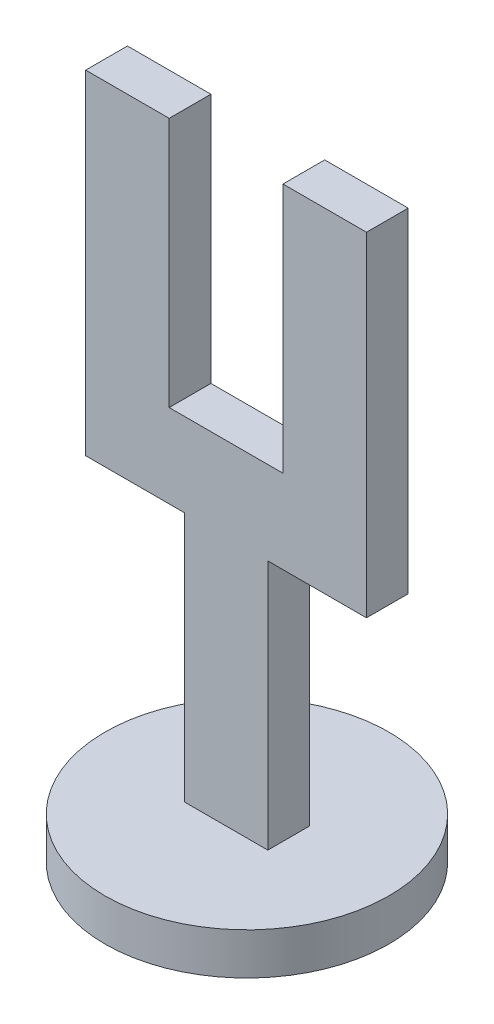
ISO-10303-21;
HEADER;
FILE_DESCRIPTION(('STEP AP214'),'2;1');
FILE_NAME('part.step','',(''),(''),'','','');
FILE_SCHEMA(('AUTOMOTIVE_DESIGN { 1 0 10303 214 1 1 1 1 }'));
ENDSEC;
DATA;
#1=APPLICATION_CONTEXT('core data for automotive mechanical design processes');
#2=APPLICATION_PROTOCOL_DEFINITION('international standard','automotive_design',2000,#1);
#3=PRODUCT_CONTEXT('',#1,'mechanical');
#4=PRODUCT('Part','Part','',(#3));
#5=PRODUCT_RELATED_PRODUCT_CATEGORY('part','',(#4));
#6=PRODUCT_DEFINITION_FORMATION('','',#4);
#7=PRODUCT_DEFINITION_CONTEXT('part definition',#1,'design');
#8=PRODUCT_DEFINITION('design','',#6,#7);
#9=PRODUCT_DEFINITION_SHAPE('','',#8);
#10=(LENGTH_UNIT() NAMED_UNIT(*) SI_UNIT(.MILLI.,.METRE.));
#11=(NAMED_UNIT(*) PLANE_ANGLE_UNIT() SI_UNIT($,.RADIAN.));
#12=(NAMED_UNIT(*) SI_UNIT($,.STERADIAN.) SOLID_ANGLE_UNIT());
#13=UNCERTAINTY_MEASURE_WITH_UNIT(LENGTH_MEASURE(1.E-05),#10,'distance_accuracy_value','');
#14=(GEOMETRIC_REPRESENTATION_CONTEXT(3) GLOBAL_UNCERTAINTY_ASSIGNED_CONTEXT((#13)) GLOBAL_UNIT_ASSIGNED_CONTEXT((#10,
#11,#12)) REPRESENTATION_CONTEXT('',''));
#15=CARTESIAN_POINT('',(0.,0.,0.));
#16=DIRECTION('',(0.,0.,1.));
#17=DIRECTION('',(1.,0.,0.));
#18=AXIS2_PLACEMENT_3D('',#15,#16,#17);
#19=CARTESIAN_POINT('',(0.,5.,0.));
#20=DIRECTION('',(0.,-1.,0.));
#21=DIRECTION('',(0.,0.,-1.));
#22=AXIS2_PLACEMENT_3D('',#19,#20,#21);
#23=CYLINDRICAL_SURFACE('',#22,17.);
#24=CARTESIAN_POINT('',(0.,5.,0.));
#25=DIRECTION('',(0.,1.,0.));
#26=DIRECTION('',(0.,0.,1.));
#27=AXIS2_PLACEMENT_3D('',#24,#25,#26);
#28=CIRCLE('',#27,17.);
#29=CARTESIAN_POINT('',(0.,5.,17.));
#30=VERTEX_POINT('',#29);
#31=EDGE_CURVE('E11',#30,#30,#28,.T.);
#32=ORIENTED_EDGE('',*,*,#31,.F.);
#33=EDGE_LOOP('',(#32));
#34=FACE_BOUND('',#33,.T.);
#35=CARTESIAN_POINT('',(0.,0.,0.));
#36=DIRECTION('',(0.,1.,0.));
#37=DIRECTION('',(0.,0.,1.));
#38=AXIS2_PLACEMENT_3D('',#35,#36,#37);
#39=CIRCLE('',#38,17.);
#40=CARTESIAN_POINT('',(0.,0.,17.));
#41=VERTEX_POINT('',#40);
#42=EDGE_CURVE('E48',#41,#41,#39,.T.);
#43=ORIENTED_EDGE('',*,*,#42,.T.);
#44=EDGE_LOOP('',(#43));
#45=FACE_BOUND('',#44,.T.);
#46=ADVANCED_FACE('F45',(#34,#45),#23,.T.);
#47=CARTESIAN_POINT('',(0.,5.,0.));
#48=DIRECTION('',(0.,1.,0.));
#49=DIRECTION('',(0.,0.,1.));
#50=AXIS2_PLACEMENT_3D('',#47,#48,#49);
#51=PLANE('',#50);
#52=DIRECTION('',(0.,0.,-1.));
#53=VECTOR('',#52,1.);
#54=CARTESIAN_POINT('',(5.,5.,-2.5));
#55=LINE('',#54,#53);
#56=CARTESIAN_POINT('',(5.,5.,2.5));
#57=VERTEX_POINT('',#56);
#58=CARTESIAN_POINT('',(5.,5.,-2.5));
#59=VERTEX_POINT('',#58);
#60=EDGE_CURVE('E232',#57,#59,#55,.T.);
#61=ORIENTED_EDGE('',*,*,#60,.F.);
#62=DIRECTION('',(1.,0.,0.));
#63=VECTOR('',#62,1.);
#64=CARTESIAN_POINT('',(-5.,5.,2.5));
#65=LINE('',#64,#63);
#66=CARTESIAN_POINT('',(-5.,5.,2.5));
#67=VERTEX_POINT('',#66);
#68=EDGE_CURVE('E238',#67,#57,#65,.T.);
#69=ORIENTED_EDGE('',*,*,#68,.F.);
#70=DIRECTION('',(0.,0.,1.));
#71=VECTOR('',#70,1.);
#72=CARTESIAN_POINT('',(-5.,5.,-2.5));
#73=LINE('',#72,#71);
#74=CARTESIAN_POINT('',(-5.,5.,-2.5));
#75=VERTEX_POINT('',#74);
#76=EDGE_CURVE('E249',#75,#67,#73,.T.);
#77=ORIENTED_EDGE('',*,*,#76,.F.);
#78=DIRECTION('',(-1.,0.,0.));
#79=VECTOR('',#78,1.);
#80=CARTESIAN_POINT('',(-5.,5.,-2.5));
#81=LINE('',#80,#79);
#82=EDGE_CURVE('E246',#59,#75,#81,.T.);
#83=ORIENTED_EDGE('',*,*,#82,.F.);
#84=EDGE_LOOP('',(#61,#69,#77,#83));
#85=FACE_BOUND('',#84,.T.);
#86=ORIENTED_EDGE('',*,*,#31,.T.);
#87=EDGE_LOOP('',(#86));
#88=FACE_BOUND('',#87,.T.);
#89=ADVANCED_FACE('F285',(#85,#88),#51,.T.);
#90=CARTESIAN_POINT('',(0.,0.,0.));
#91=DIRECTION('',(0.,1.,0.));
#92=DIRECTION('',(0.,0.,1.));
#93=AXIS2_PLACEMENT_3D('',#90,#91,#92);
#94=PLANE('',#93);
#95=CARTESIAN_POINT('',(0.,0.,0.));
#96=DIRECTION('',(0.,-1.,0.));
#97=DIRECTION('',(0.,0.,-1.));
#98=AXIS2_PLACEMENT_3D('',#95,#96,#97);
#99=CIRCLE('',#98,15.5);
#100=CARTESIAN_POINT('',(0.,0.,-15.5));
#101=VERTEX_POINT('',#100);
#102=EDGE_CURVE('E271',#101,#101,#99,.T.);
#103=ORIENTED_EDGE('',*,*,#102,.F.);
#104=EDGE_LOOP('',(#103));
#105=FACE_BOUND('',#104,.T.);
#106=ORIENTED_EDGE('',*,*,#42,.F.);
#107=EDGE_LOOP('',(#106));
#108=FACE_BOUND('',#107,.T.);
#109=ADVANCED_FACE('F282',(#105,#108),#94,.F.);
#110=CARTESIAN_POINT('',(0.,2.5,0.));
#111=DIRECTION('',(0.,-1.,0.));
#112=DIRECTION('',(0.,0.,-1.));
#113=AXIS2_PLACEMENT_3D('',#110,#111,#112);
#114=CYLINDRICAL_SURFACE('',#113,15.5);
#115=CARTESIAN_POINT('',(0.,2.5,0.));
#116=DIRECTION('',(0.,-1.,0.));
#117=DIRECTION('',(0.,0.,-1.));
#118=AXIS2_PLACEMENT_3D('',#115,#116,#117);
#119=CIRCLE('',#118,15.5);
#120=CARTESIAN_POINT('',(0.,2.5,-15.5));
#121=VERTEX_POINT('',#120);
#122=EDGE_CURVE('E272',#121,#121,#119,.T.);
#123=ORIENTED_EDGE('',*,*,#122,.F.);
#124=EDGE_LOOP('',(#123));
#125=FACE_BOUND('',#124,.T.);
#126=ORIENTED_EDGE('',*,*,#102,.T.);
#127=EDGE_LOOP('',(#126));
#128=FACE_BOUND('',#127,.T.);
#129=ADVANCED_FACE('F280',(#125,#128),#114,.F.);
#130=CARTESIAN_POINT('',(0.,2.5,0.));
#131=DIRECTION('',(0.,-1.,0.));
#132=DIRECTION('',(0.,0.,-1.));
#133=AXIS2_PLACEMENT_3D('',#130,#131,#132);
#134=PLANE('',#133);
#135=ORIENTED_EDGE('',*,*,#122,.T.);
#136=EDGE_LOOP('',(#135));
#137=FACE_BOUND('',#136,.T.);
#138=ADVANCED_FACE('F306',(#137),#134,.T.);
#139=CARTESIAN_POINT('',(5.,35.,-2.5));
#140=DIRECTION('',(-1.,0.,0.));
#141=DIRECTION('',(0.,0.,1.));
#142=AXIS2_PLACEMENT_3D('',#139,#140,#141);
#143=PLANE('',#142);
#144=ORIENTED_EDGE('',*,*,#60,.T.);
#145=DIRECTION('',(0.,-1.,0.));
#146=VECTOR('',#145,1.);
#147=CARTESIAN_POINT('',(5.,35.,-2.5));
#148=LINE('',#147,#146);
#149=CARTESIAN_POINT('',(5.,35.,-2.5));
#150=VERTEX_POINT('',#149);
#151=EDGE_CURVE('E267',#150,#59,#148,.T.);
#152=ORIENTED_EDGE('',*,*,#151,.F.);
#153=DIRECTION('',(0.,0.,-1.));
#154=VECTOR('',#153,1.);
#155=CARTESIAN_POINT('',(5.,35.,-2.5));
#156=LINE('',#155,#154);
#157=CARTESIAN_POINT('',(5.,35.,2.5));
#158=VERTEX_POINT('',#157);
#159=EDGE_CURVE('E233',#158,#150,#156,.T.);
#160=ORIENTED_EDGE('',*,*,#159,.F.);
#161=DIRECTION('',(0.,-1.,0.));
#162=VECTOR('',#161,1.);
#163=CARTESIAN_POINT('',(5.,35.,2.5));
#164=LINE('',#163,#162);
#165=EDGE_CURVE('E242',#158,#57,#164,.T.);
#166=ORIENTED_EDGE('',*,*,#165,.T.);
#167=EDGE_LOOP('',(#144,#152,#160,#166));
#168=FACE_BOUND('',#167,.T.);
#169=ADVANCED_FACE('F309',(#168),#143,.F.);
#170=CARTESIAN_POINT('',(-5.,35.,-2.5));
#171=DIRECTION('',(0.,0.,1.));
#172=DIRECTION('',(1.,0.,0.));
#173=AXIS2_PLACEMENT_3D('',#170,#171,#172);
#174=PLANE('',#173);
#175=ORIENTED_EDGE('',*,*,#82,.T.);
#176=DIRECTION('',(0.,-1.,0.));
#177=VECTOR('',#176,1.);
#178=CARTESIAN_POINT('',(-5.,35.,-2.5));
#179=LINE('',#178,#177);
#180=CARTESIAN_POINT('',(-5.,35.,-2.5));
#181=VERTEX_POINT('',#180);
#182=EDGE_CURVE('E263',#181,#75,#179,.T.);
#183=ORIENTED_EDGE('',*,*,#182,.F.);
#184=DIRECTION('',(-1.,0.,0.));
#185=VECTOR('',#184,1.);
#186=CARTESIAN_POINT('',(16.8151717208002,35.,-2.5));
#187=LINE('',#186,#185);
#188=CARTESIAN_POINT('',(-16.8151717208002,35.,-2.5));
#189=VERTEX_POINT('',#188);
#190=EDGE_CURVE('E220',#181,#189,#187,.T.);
#191=ORIENTED_EDGE('',*,*,#190,.T.);
#192=DIRECTION('',(0.,-1.,0.));
#193=VECTOR('',#192,1.);
#194=CARTESIAN_POINT('',(-16.8151717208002,45.,-2.5));
#195=LINE('',#194,#193);
#196=CARTESIAN_POINT('',(-16.8151717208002,75.,-2.5));
#197=VERTEX_POINT('',#196);
#198=EDGE_CURVE('E146',#197,#189,#195,.T.);
#199=ORIENTED_EDGE('',*,*,#198,.F.);
#200=DIRECTION('',(-1.,0.,0.));
#201=VECTOR('',#200,1.);
#202=CARTESIAN_POINT('',(-16.8151717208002,75.,-2.5));
#203=LINE('',#202,#201);
#204=CARTESIAN_POINT('',(-6.81517172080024,75.,-2.49999999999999));
#205=VERTEX_POINT('',#204);
#206=EDGE_CURVE('E187',#205,#197,#203,.T.);
#207=ORIENTED_EDGE('',*,*,#206,.F.);
#208=DIRECTION('',(0.,-1.,0.));
#209=VECTOR('',#208,1.);
#210=CARTESIAN_POINT('',(-6.81517172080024,75.,-2.49999999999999));
#211=LINE('',#210,#209);
#212=CARTESIAN_POINT('',(-6.81517172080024,45.,-2.49999999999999));
#213=VERTEX_POINT('',#212);
#214=EDGE_CURVE('E183',#205,#213,#211,.T.);
#215=ORIENTED_EDGE('',*,*,#214,.T.);
#216=DIRECTION('',(-1.,0.,0.));
#217=VECTOR('',#216,1.);
#218=CARTESIAN_POINT('',(16.8151717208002,45.,-2.5));
#219=LINE('',#218,#217);
#220=CARTESIAN_POINT('',(6.81517172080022,45.,-2.5));
#221=VERTEX_POINT('',#220);
#222=EDGE_CURVE('E206',#221,#213,#219,.T.);
#223=ORIENTED_EDGE('',*,*,#222,.F.);
#224=DIRECTION('',(0.,-1.,0.));
#225=VECTOR('',#224,1.);
#226=CARTESIAN_POINT('',(6.81517172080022,75.,-2.5));
#227=LINE('',#226,#225);
#228=CARTESIAN_POINT('',(6.81517172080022,75.,-2.5));
#229=VERTEX_POINT('',#228);
#230=EDGE_CURVE('E153',#229,#221,#227,.T.);
#231=ORIENTED_EDGE('',*,*,#230,.F.);
#232=DIRECTION('',(-1.,0.,0.));
#233=VECTOR('',#232,1.);
#234=CARTESIAN_POINT('',(16.8151717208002,75.,-2.5));
#235=LINE('',#234,#233);
#236=CARTESIAN_POINT('',(16.8151717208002,75.,-2.5));
#237=VERTEX_POINT('',#236);
#238=EDGE_CURVE('E149',#237,#229,#235,.T.);
#239=ORIENTED_EDGE('',*,*,#238,.F.);
#240=DIRECTION('',(0.,-1.,0.));
#241=VECTOR('',#240,1.);
#242=CARTESIAN_POINT('',(16.8151717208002,45.,-2.5));
#243=LINE('',#242,#241);
#244=CARTESIAN_POINT('',(16.8151717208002,35.,-2.5));
#245=VERTEX_POINT('',#244);
#246=EDGE_CURVE('E133',#237,#245,#243,.T.);
#247=ORIENTED_EDGE('',*,*,#246,.T.);
#248=EDGE_CURVE('E207',#245,#150,#187,.T.);
#249=ORIENTED_EDGE('',*,*,#248,.T.);
#250=ORIENTED_EDGE('',*,*,#151,.T.);
#251=EDGE_LOOP('',(#175,#183,#191,#199,#207,#215,#223,#231,#239,#247,#249,#250));
#252=FACE_BOUND('',#251,.T.);
#253=ADVANCED_FACE('F151',(#252),#174,.F.);
#254=CARTESIAN_POINT('',(-5.,35.,-2.5));
#255=DIRECTION('',(1.,0.,0.));
#256=DIRECTION('',(0.,0.,-1.));
#257=AXIS2_PLACEMENT_3D('',#254,#255,#256);
#258=PLANE('',#257);
#259=ORIENTED_EDGE('',*,*,#76,.T.);
#260=DIRECTION('',(0.,-1.,0.));
#261=VECTOR('',#260,1.);
#262=CARTESIAN_POINT('',(-5.,35.,2.5));
#263=LINE('',#262,#261);
#264=CARTESIAN_POINT('',(-5.,35.,2.5));
#265=VERTEX_POINT('',#264);
#266=EDGE_CURVE('E259',#265,#67,#263,.T.);
#267=ORIENTED_EDGE('',*,*,#266,.F.);
#268=DIRECTION('',(0.,0.,1.));
#269=VECTOR('',#268,1.);
#270=CARTESIAN_POINT('',(-5.,35.,-2.5));
#271=LINE('',#270,#269);
#272=EDGE_CURVE('E237',#181,#265,#271,.T.);
#273=ORIENTED_EDGE('',*,*,#272,.F.);
#274=ORIENTED_EDGE('',*,*,#182,.T.);
#275=EDGE_LOOP('',(#259,#267,#273,#274));
#276=FACE_BOUND('',#275,.T.);
#277=ADVANCED_FACE('F315',(#276),#258,.F.);
#278=CARTESIAN_POINT('',(-5.,35.,2.5));
#279=DIRECTION('',(0.,0.,-1.));
#280=DIRECTION('',(-1.,0.,0.));
#281=AXIS2_PLACEMENT_3D('',#278,#279,#280);
#282=PLANE('',#281);
#283=ORIENTED_EDGE('',*,*,#68,.T.);
#284=ORIENTED_EDGE('',*,*,#165,.F.);
#285=DIRECTION('',(1.,0.,0.));
#286=VECTOR('',#285,1.);
#287=CARTESIAN_POINT('',(16.8151717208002,35.,2.5));
#288=LINE('',#287,#286);
#289=CARTESIAN_POINT('',(16.8151717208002,35.,2.5));
#290=VERTEX_POINT('',#289);
#291=EDGE_CURVE('E213',#158,#290,#288,.T.);
#292=ORIENTED_EDGE('',*,*,#291,.T.);
#293=DIRECTION('',(0.,-1.,0.));
#294=VECTOR('',#293,1.);
#295=CARTESIAN_POINT('',(16.8151717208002,45.,2.5));
#296=LINE('',#295,#294);
#297=CARTESIAN_POINT('',(16.8151717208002,75.,2.5));
#298=VERTEX_POINT('',#297);
#299=EDGE_CURVE('E145',#298,#290,#296,.T.);
#300=ORIENTED_EDGE('',*,*,#299,.F.);
#301=DIRECTION('',(1.,0.,0.));
#302=VECTOR('',#301,1.);
#303=CARTESIAN_POINT('',(16.8151717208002,75.,2.5));
#304=LINE('',#303,#302);
#305=CARTESIAN_POINT('',(6.81517172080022,75.,2.5));
#306=VERTEX_POINT('',#305);
#307=EDGE_CURVE('E162',#306,#298,#304,.T.);
#308=ORIENTED_EDGE('',*,*,#307,.F.);
#309=DIRECTION('',(0.,-1.,0.));
#310=VECTOR('',#309,1.);
#311=CARTESIAN_POINT('',(6.81517172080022,75.,2.5));
#312=LINE('',#311,#310);
#313=CARTESIAN_POINT('',(6.81517172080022,45.,2.5));
#314=VERTEX_POINT('',#313);
#315=EDGE_CURVE('E171',#306,#314,#312,.T.);
#316=ORIENTED_EDGE('',*,*,#315,.T.);
#317=DIRECTION('',(1.,0.,0.));
#318=VECTOR('',#317,1.);
#319=CARTESIAN_POINT('',(16.8151717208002,45.,2.5));
#320=LINE('',#319,#318);
#321=CARTESIAN_POINT('',(-6.81517172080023,45.,2.5));
#322=VERTEX_POINT('',#321);
#323=EDGE_CURVE('E203',#322,#314,#320,.T.);
#324=ORIENTED_EDGE('',*,*,#323,.F.);
#325=DIRECTION('',(0.,-1.,0.));
#326=VECTOR('',#325,1.);
#327=CARTESIAN_POINT('',(-6.81517172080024,75.,2.5));
#328=LINE('',#327,#326);
#329=CARTESIAN_POINT('',(-6.81517172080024,75.,2.5));
#330=VERTEX_POINT('',#329);
#331=EDGE_CURVE('E179',#330,#322,#328,.T.);
#332=ORIENTED_EDGE('',*,*,#331,.F.);
#333=DIRECTION('',(1.,0.,0.));
#334=VECTOR('',#333,1.);
#335=CARTESIAN_POINT('',(-16.8151717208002,75.,2.5));
#336=LINE('',#335,#334);
#337=CARTESIAN_POINT('',(-16.8151717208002,75.,2.5));
#338=VERTEX_POINT('',#337);
#339=EDGE_CURVE('E197',#338,#330,#336,.T.);
#340=ORIENTED_EDGE('',*,*,#339,.F.);
#341=DIRECTION('',(0.,-1.,0.));
#342=VECTOR('',#341,1.);
#343=CARTESIAN_POINT('',(-16.8151717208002,45.,2.5));
#344=LINE('',#343,#342);
#345=CARTESIAN_POINT('',(-16.8151717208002,35.,2.5));
#346=VERTEX_POINT('',#345);
#347=EDGE_CURVE('E228',#338,#346,#344,.T.);
#348=ORIENTED_EDGE('',*,*,#347,.T.);
#349=EDGE_CURVE('E214',#346,#265,#288,.T.);
#350=ORIENTED_EDGE('',*,*,#349,.T.);
#351=ORIENTED_EDGE('',*,*,#266,.T.);
#352=EDGE_LOOP('',(#283,#284,#292,#300,#308,#316,#324,#332,#340,#348,#350,#351));
#353=FACE_BOUND('',#352,.T.);
#354=ADVANCED_FACE('F318',(#353),#282,.F.);
#355=CARTESIAN_POINT('',(0.,35.,0.));
#356=DIRECTION('',(0.,1.,0.));
#357=DIRECTION('',(0.,0.,1.));
#358=AXIS2_PLACEMENT_3D('',#355,#356,#357);
#359=PLANE('',#358);
#360=ORIENTED_EDGE('',*,*,#291,.F.);
#361=ORIENTED_EDGE('',*,*,#159,.T.);
#362=ORIENTED_EDGE('',*,*,#248,.F.);
#363=DIRECTION('',(0.,0.,-1.));
#364=VECTOR('',#363,1.);
#365=CARTESIAN_POINT('',(16.8151717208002,35.,2.5));
#366=LINE('',#365,#364);
#367=EDGE_CURVE('E140',#290,#245,#366,.T.);
#368=ORIENTED_EDGE('',*,*,#367,.F.);
#369=EDGE_LOOP('',(#360,#361,#362,#368));
#370=FACE_BOUND('',#369,.T.);
#371=ADVANCED_FACE('F322',(#370),#359,.F.);
#372=ORIENTED_EDGE('',*,*,#190,.F.);
#373=ORIENTED_EDGE('',*,*,#272,.T.);
#374=ORIENTED_EDGE('',*,*,#349,.F.);
#375=DIRECTION('',(0.,0.,1.));
#376=VECTOR('',#375,1.);
#377=CARTESIAN_POINT('',(-16.8151717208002,35.,2.5));
#378=LINE('',#377,#376);
#379=EDGE_CURVE('E178',#189,#346,#378,.T.);
#380=ORIENTED_EDGE('',*,*,#379,.F.);
#381=EDGE_LOOP('',(#372,#373,#374,#380));
#382=FACE_BOUND('',#381,.T.);
#383=ADVANCED_FACE('F327',(#382),#359,.F.);
#384=CARTESIAN_POINT('',(-16.8151717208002,45.,2.5));
#385=DIRECTION('',(1.,0.,0.));
#386=DIRECTION('',(0.,0.,-1.));
#387=AXIS2_PLACEMENT_3D('',#384,#385,#386);
#388=PLANE('',#387);
#389=ORIENTED_EDGE('',*,*,#379,.T.);
#390=ORIENTED_EDGE('',*,*,#347,.F.);
#391=DIRECTION('',(0.,0.,1.));
#392=VECTOR('',#391,1.);
#393=CARTESIAN_POINT('',(-16.8151717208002,75.,-2.5));
#394=LINE('',#393,#392);
#395=EDGE_CURVE('E190',#197,#338,#394,.T.);
#396=ORIENTED_EDGE('',*,*,#395,.F.);
#397=ORIENTED_EDGE('',*,*,#198,.T.);
#398=EDGE_LOOP('',(#389,#390,#396,#397));
#399=FACE_BOUND('',#398,.T.);
#400=ADVANCED_FACE('F324',(#399),#388,.F.);
#401=CARTESIAN_POINT('',(16.8151717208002,45.,2.5));
#402=DIRECTION('',(-1.,0.,0.));
#403=DIRECTION('',(0.,0.,1.));
#404=AXIS2_PLACEMENT_3D('',#401,#402,#403);
#405=PLANE('',#404);
#406=ORIENTED_EDGE('',*,*,#367,.T.);
#407=ORIENTED_EDGE('',*,*,#246,.F.);
#408=DIRECTION('',(0.,0.,-1.));
#409=VECTOR('',#408,1.);
#410=CARTESIAN_POINT('',(16.8151717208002,75.,-2.5));
#411=LINE('',#410,#409);
#412=EDGE_CURVE('E138',#298,#237,#411,.T.);
#413=ORIENTED_EDGE('',*,*,#412,.F.);
#414=ORIENTED_EDGE('',*,*,#299,.T.);
#415=EDGE_LOOP('',(#406,#407,#413,#414));
#416=FACE_BOUND('',#415,.T.);
#417=ADVANCED_FACE('F135',(#416),#405,.F.);
#418=CARTESIAN_POINT('',(0.,45.,0.));
#419=DIRECTION('',(0.,1.,0.));
#420=DIRECTION('',(0.,0.,1.));
#421=AXIS2_PLACEMENT_3D('',#418,#419,#420);
#422=PLANE('',#421);
#423=DIRECTION('',(0.,0.,1.));
#424=VECTOR('',#423,1.);
#425=CARTESIAN_POINT('',(6.81517172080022,45.,-2.5));
#426=LINE('',#425,#424);
#427=EDGE_CURVE('E60',#221,#314,#426,.T.);
#428=ORIENTED_EDGE('',*,*,#427,.F.);
#429=ORIENTED_EDGE('',*,*,#222,.T.);
#430=DIRECTION('',(0.,0.,-1.));
#431=VECTOR('',#430,1.);
#432=CARTESIAN_POINT('',(-6.81517172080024,45.,-2.49999999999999));
#433=LINE('',#432,#431);
#434=EDGE_CURVE('E65',#322,#213,#433,.T.);
#435=ORIENTED_EDGE('',*,*,#434,.F.);
#436=ORIENTED_EDGE('',*,*,#323,.T.);
#437=EDGE_LOOP('',(#428,#429,#435,#436));
#438=FACE_BOUND('',#437,.T.);
#439=ADVANCED_FACE('F331',(#438),#422,.T.);
#440=CARTESIAN_POINT('',(-6.81517172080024,75.,-2.49999999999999));
#441=DIRECTION('',(-1.,0.,0.));
#442=DIRECTION('',(0.,0.,1.));
#443=AXIS2_PLACEMENT_3D('',#440,#441,#442);
#444=PLANE('',#443);
#445=ORIENTED_EDGE('',*,*,#434,.T.);
#446=ORIENTED_EDGE('',*,*,#214,.F.);
#447=DIRECTION('',(0.,0.,-1.));
#448=VECTOR('',#447,1.);
#449=CARTESIAN_POINT('',(-6.81517172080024,75.,-2.49999999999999));
#450=LINE('',#449,#448);
#451=EDGE_CURVE('E194',#330,#205,#450,.T.);
#452=ORIENTED_EDGE('',*,*,#451,.F.);
#453=ORIENTED_EDGE('',*,*,#331,.T.);
#454=EDGE_LOOP('',(#445,#446,#452,#453));
#455=FACE_BOUND('',#454,.T.);
#456=ADVANCED_FACE('F337',(#455),#444,.F.);
#457=CARTESIAN_POINT('',(0.,75.,0.));
#458=DIRECTION('',(0.,1.,0.));
#459=DIRECTION('',(0.,0.,1.));
#460=AXIS2_PLACEMENT_3D('',#457,#458,#459);
#461=PLANE('',#460);
#462=ORIENTED_EDGE('',*,*,#395,.T.);
#463=ORIENTED_EDGE('',*,*,#339,.T.);
#464=ORIENTED_EDGE('',*,*,#451,.T.);
#465=ORIENTED_EDGE('',*,*,#206,.T.);
#466=EDGE_LOOP('',(#462,#463,#464,#465));
#467=FACE_BOUND('',#466,.T.);
#468=ADVANCED_FACE('F338',(#467),#461,.T.);
#469=CARTESIAN_POINT('',(6.81517172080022,75.,-2.5));
#470=DIRECTION('',(1.,0.,0.));
#471=DIRECTION('',(0.,0.,-1.));
#472=AXIS2_PLACEMENT_3D('',#469,#470,#471);
#473=PLANE('',#472);
#474=ORIENTED_EDGE('',*,*,#427,.T.);
#475=ORIENTED_EDGE('',*,*,#315,.F.);
#476=DIRECTION('',(0.,0.,1.));
#477=VECTOR('',#476,1.);
#478=CARTESIAN_POINT('',(6.81517172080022,75.,-2.5));
#479=LINE('',#478,#477);
#480=EDGE_CURVE('E157',#229,#306,#479,.T.);
#481=ORIENTED_EDGE('',*,*,#480,.F.);
#482=ORIENTED_EDGE('',*,*,#230,.T.);
#483=EDGE_LOOP('',(#474,#475,#481,#482));
#484=FACE_BOUND('',#483,.T.);
#485=ADVANCED_FACE('F341',(#484),#473,.F.);
#486=CARTESIAN_POINT('',(0.,75.,0.));
#487=DIRECTION('',(0.,-1.,0.));
#488=DIRECTION('',(0.,0.,-1.));
#489=AXIS2_PLACEMENT_3D('',#486,#487,#488);
#490=PLANE('',#489);
#491=ORIENTED_EDGE('',*,*,#412,.T.);
#492=ORIENTED_EDGE('',*,*,#238,.T.);
#493=ORIENTED_EDGE('',*,*,#480,.T.);
#494=ORIENTED_EDGE('',*,*,#307,.T.);
#495=EDGE_LOOP('',(#491,#492,#493,#494));
#496=FACE_BOUND('',#495,.T.);
#497=ADVANCED_FACE('F160',(#496),#490,.F.);
#498=CLOSED_SHELL('',(#46,#89,#109,#129,#138,#169,#253,#277,#354,#371,#383,#400,#417,#439,#456,
#468,#485,#497));
#499=MANIFOLD_SOLID_BREP('B2',#498);
#500=ADVANCED_BREP_SHAPE_REPRESENTATION('',(#18,#499),#14);
#501=SHAPE_DEFINITION_REPRESENTATION(#9,#500);
ENDSEC;
END-ISO-10303-21;
